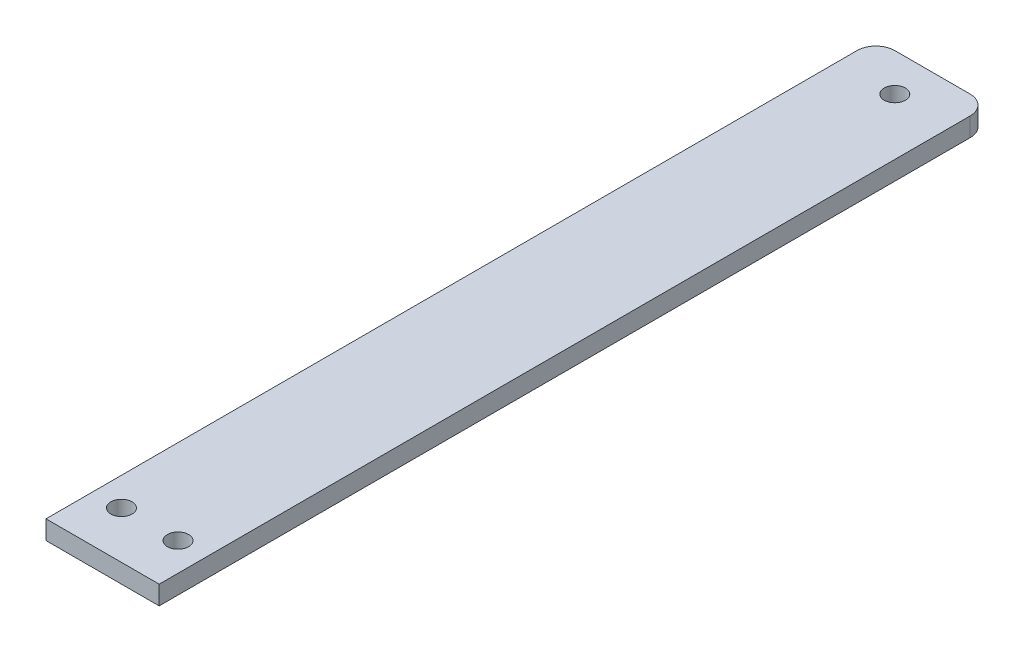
from build123d import *

# Parameters (mm, degrees)
SKETCH1_W           = 38.1
SKETCH1_H           = 279.4
SKETCH1_R           = 3.571875
BOSS_EXTRUDE1_DEPTH = 6.35
FILLET1_R           = 6.35


with BuildPart() as part:
    # Sketch1 → Boss-Extrude1 (new body)
    with BuildSketch(Plane(origin=(0, 0, 0), x_dir=(1, 0, 0), z_dir=(0, 1, 0))):
        Rectangle(SKETCH1_W, SKETCH1_H)
        with Locations(Location((0, 127, 0), (0, 0, 270))):
            Circle(SKETCH1_R, mode=Mode.SUBTRACT)
        with Locations(Location((-9.525, -123.825, 0), (0, 0, 270))):
            Circle(SKETCH1_R, mode=Mode.SUBTRACT)
        with Locations(Location((9.525, -123.825, 0), (0, 0, 270))):
            Circle(SKETCH1_R, mode=Mode.SUBTRACT)
    extrude(amount=BOSS_EXTRUDE1_DEPTH)

    # Fillet1
    fillet1_edges = [part.edges().sort_by_distance(p)[0] for p in [
        (-19.05, 3.175, -139.7),
        (19.05, 3.175, -139.7),
    ]]
    fillet(fillet1_edges, radius=FILLET1_R)


solid = part.part
